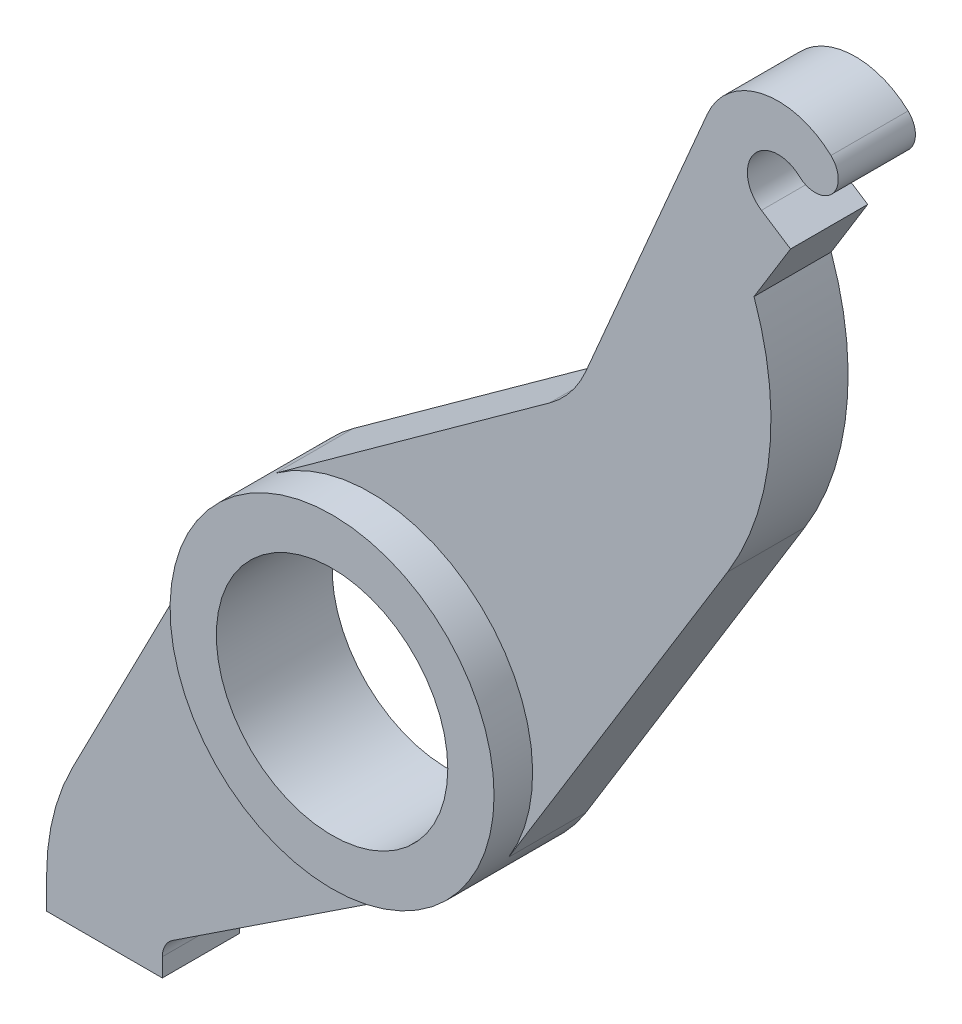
from build123d import *

# Parameters (mm, degrees)
ESQUISSE1_R        = 15
BOSS_EXTRU_1_DEPTH = 10
ESQUISSE2_R        = 21
ESQUISSE2_R_2      = 15
BOSS_EXTRU_2_DEPTH = 5


with BuildPart() as part:
    # Esquisse1 → Boss.-Extru.1 (new body)
    with BuildSketch(Plane.XY):
        with BuildLine():
            Line((-18.673838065, 9.606652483), (-38.676911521, -29.276210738))
            ThreePointArc((-38.676911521, -29.276210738), (-41.157394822, -35.939806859), (-42, -43))
            Line((-42, -43), (-42, -47))
            Line((-42, -47), (-27, -47))
            Line((-27, -47), (-27, -44.613848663))
            ThreePointArc((-27, -44.613848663), (-26.64197773, -43.19259792), (-25.653364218, -42.110573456))
            Line((-25.653364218, -42.110573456), (11.573549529, -17.522926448))
            ThreePointArc((11.573549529, -17.522926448), (15.091865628, -14.602588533), (17.894706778, -10.989971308))
            Line((17.894706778, -10.989971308), (46.271552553, 35.215366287))
            ThreePointArc((46.271552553, 35.215366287), (51.683442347, 51.139003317), (49.692479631, 67.838908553))
            Line((49.692479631, 67.838908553), (54.425447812, 75.545487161))
            Line((54.425447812, 75.545487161), (50.651430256, 77.996362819))
            ThreePointArc((50.651430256, 77.996362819), (49.679542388, 83.815736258), (55.561774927, 84.27291631))
            ThreePointArc((55.561774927, 84.27291631), (59.80201974, 84.415478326), (59.659457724, 88.655723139))
            ThreePointArc((59.659457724, 88.655723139), (50.773825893, 91.137372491), (43.638254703, 85.289581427))
            Line((43.638254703, 85.289581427), (27.868424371, 48.486049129))
            ThreePointArc((27.868424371, 48.486049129), (25.928753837, 45.250009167), (23.195395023, 42.649427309))
            Line((23.195395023, 42.649427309), (-12.293092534, 17.025859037))
            ThreePointArc((-12.293092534, 17.025859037), (-15.921647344, 13.693105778), (-18.673838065, 9.606652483))
        make_face()
        Circle(ESQUISSE1_R, mode=Mode.SUBTRACT)
    extrude(amount=BOSS_EXTRU_1_DEPTH)

    # Esquisse2 → Boss.-Extru.2 (add)
    with BuildSketch(Plane.XY.offset(10)):
        with Locations(Location((0, 0, 0), (0, 0, 152.776696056))):
            Circle(ESQUISSE2_R)
        Circle(ESQUISSE2_R_2, mode=Mode.SUBTRACT)
    extrude(amount=BOSS_EXTRU_2_DEPTH)


solid = part.part
